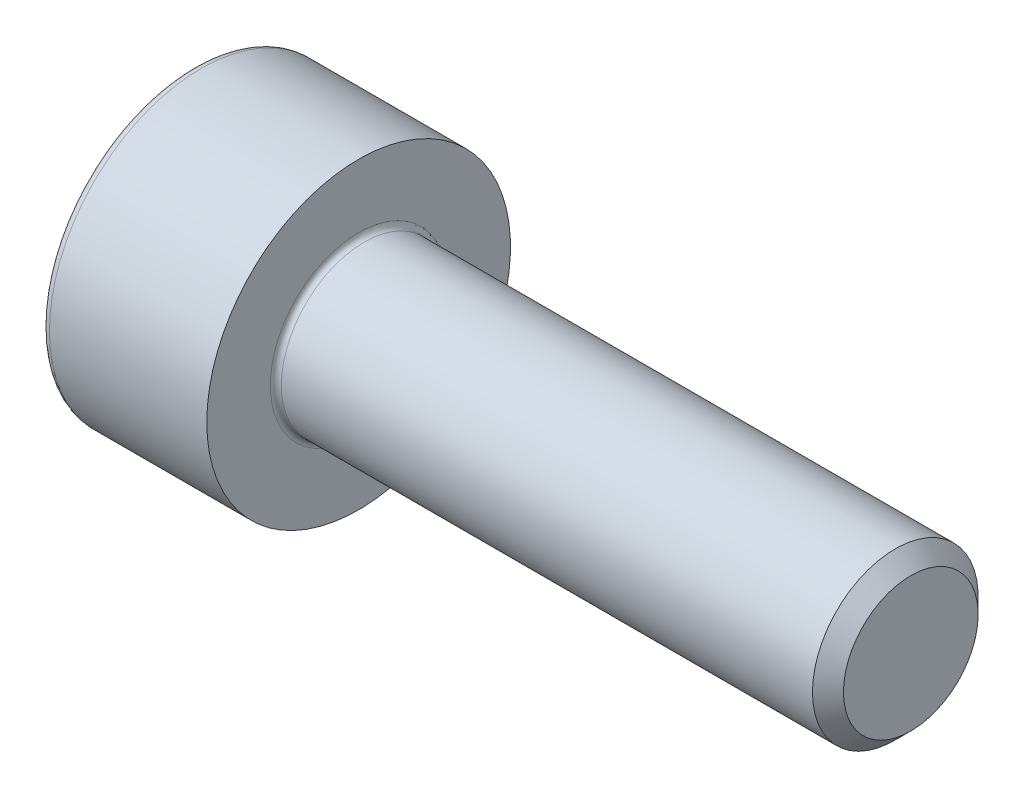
ISO-10303-21;
HEADER;
FILE_DESCRIPTION(('STEP AP214'),'2;1');
FILE_NAME('part.step','',(''),(''),'','','');
FILE_SCHEMA(('AUTOMOTIVE_DESIGN { 1 0 10303 214 1 1 1 1 }'));
ENDSEC;
DATA;
#1=APPLICATION_CONTEXT('core data for automotive mechanical design processes');
#2=APPLICATION_PROTOCOL_DEFINITION('international standard','automotive_design',2000,#1);
#3=PRODUCT_CONTEXT('',#1,'mechanical');
#4=PRODUCT('Part','Part','',(#3));
#5=PRODUCT_RELATED_PRODUCT_CATEGORY('part','',(#4));
#6=PRODUCT_DEFINITION_FORMATION('','',#4);
#7=PRODUCT_DEFINITION_CONTEXT('part definition',#1,'design');
#8=PRODUCT_DEFINITION('design','',#6,#7);
#9=PRODUCT_DEFINITION_SHAPE('','',#8);
#10=(LENGTH_UNIT() NAMED_UNIT(*) SI_UNIT(.MILLI.,.METRE.));
#11=(NAMED_UNIT(*) PLANE_ANGLE_UNIT() SI_UNIT($,.RADIAN.));
#12=(NAMED_UNIT(*) SI_UNIT($,.STERADIAN.) SOLID_ANGLE_UNIT());
#13=UNCERTAINTY_MEASURE_WITH_UNIT(LENGTH_MEASURE(1.E-05),#10,'distance_accuracy_value','');
#14=(GEOMETRIC_REPRESENTATION_CONTEXT(3) GLOBAL_UNCERTAINTY_ASSIGNED_CONTEXT((#13)) GLOBAL_UNIT_ASSIGNED_CONTEXT((#10,
#11,#12)) REPRESENTATION_CONTEXT('',''));
#15=CARTESIAN_POINT('',(0.,0.,0.));
#16=DIRECTION('',(0.,0.,1.));
#17=DIRECTION('',(1.,0.,0.));
#18=AXIS2_PLACEMENT_3D('',#15,#16,#17);
#19=CARTESIAN_POINT('',(0.,0.,0.));
#20=DIRECTION('',(-1.,0.,0.));
#21=DIRECTION('',(0.,0.,1.));
#22=AXIS2_PLACEMENT_3D('',#19,#20,#21);
#23=PLANE('',#22);
#24=DIRECTION('',(0.,-0.499999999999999,0.866025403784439));
#25=VECTOR('',#24,1.);
#26=CARTESIAN_POINT('',(0.,1.47801668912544,0.));
#27=LINE('',#26,#25);
#28=CARTESIAN_POINT('',(0.,1.47801668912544,0.));
#29=VERTEX_POINT('',#28);
#30=CARTESIAN_POINT('',(0.,0.739008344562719,1.28));
#31=VERTEX_POINT('',#30);
#32=EDGE_CURVE('E117',#29,#31,#27,.T.);
#33=ORIENTED_EDGE('',*,*,#32,.T.);
#34=DIRECTION('',(0.,1.,0.));
#35=VECTOR('',#34,1.);
#36=CARTESIAN_POINT('',(0.,-0.739008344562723,1.28));
#37=LINE('',#36,#35);
#38=CARTESIAN_POINT('',(0.,-0.739008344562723,1.28));
#39=VERTEX_POINT('',#38);
#40=EDGE_CURVE('E106',#39,#31,#37,.T.);
#41=ORIENTED_EDGE('',*,*,#40,.F.);
#42=DIRECTION('',(0.,-0.500000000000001,-0.866025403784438));
#43=VECTOR('',#42,1.);
#44=CARTESIAN_POINT('',(0.,-0.739008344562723,1.28));
#45=LINE('',#44,#43);
#46=CARTESIAN_POINT('',(0.,-1.47801668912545,0.));
#47=VERTEX_POINT('',#46);
#48=EDGE_CURVE('E116',#39,#47,#45,.T.);
#49=ORIENTED_EDGE('',*,*,#48,.T.);
#50=DIRECTION('',(0.,0.499999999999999,-0.866025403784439));
#51=VECTOR('',#50,1.);
#52=CARTESIAN_POINT('',(0.,-1.47801668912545,0.));
#53=LINE('',#52,#51);
#54=CARTESIAN_POINT('',(0.,-0.739008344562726,-1.28));
#55=VERTEX_POINT('',#54);
#56=EDGE_CURVE('E135',#47,#55,#53,.T.);
#57=ORIENTED_EDGE('',*,*,#56,.T.);
#58=DIRECTION('',(0.,-1.,0.));
#59=VECTOR('',#58,1.);
#60=CARTESIAN_POINT('',(0.,0.739008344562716,-1.28));
#61=LINE('',#60,#59);
#62=CARTESIAN_POINT('',(0.,0.739008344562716,-1.28));
#63=VERTEX_POINT('',#62);
#64=EDGE_CURVE('E138',#63,#55,#61,.T.);
#65=ORIENTED_EDGE('',*,*,#64,.F.);
#66=DIRECTION('',(0.,-0.500000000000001,-0.866025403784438));
#67=VECTOR('',#66,1.);
#68=CARTESIAN_POINT('',(0.,1.47801668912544,0.));
#69=LINE('',#68,#67);
#70=EDGE_CURVE('E131',#29,#63,#69,.T.);
#71=ORIENTED_EDGE('',*,*,#70,.F.);
#72=EDGE_LOOP('',(#33,#41,#49,#57,#65,#71));
#73=FACE_BOUND('',#72,.T.);
#74=CARTESIAN_POINT('',(0.,0.,0.));
#75=DIRECTION('',(-1.,0.,0.));
#76=DIRECTION('',(0.,0.,1.));
#77=AXIS2_PLACEMENT_3D('',#74,#75,#76);
#78=CIRCLE('',#77,2.6);
#79=CARTESIAN_POINT('',(0.,0.,2.6));
#80=VERTEX_POINT('',#79);
#81=EDGE_CURVE('E42',#80,#80,#78,.T.);
#82=ORIENTED_EDGE('',*,*,#81,.T.);
#83=EDGE_LOOP('',(#82));
#84=FACE_BOUND('',#83,.T.);
#85=ADVANCED_FACE('F35',(#73,#84),#23,.T.);
#86=CARTESIAN_POINT('',(-31.75,0.,0.));
#87=DIRECTION('',(-1.,0.,0.));
#88=DIRECTION('',(0.,0.,1.));
#89=AXIS2_PLACEMENT_3D('',#86,#87,#88);
#90=CYLINDRICAL_SURFACE('',#89,2.75);
#91=CARTESIAN_POINT('',(0.149999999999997,0.,0.));
#92=DIRECTION('',(-1.,0.,0.));
#93=DIRECTION('',(0.,0.,1.));
#94=AXIS2_PLACEMENT_3D('',#91,#92,#93);
#95=CIRCLE('',#94,2.75);
#96=CARTESIAN_POINT('',(0.149999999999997,0.,2.75));
#97=VERTEX_POINT('',#96);
#98=EDGE_CURVE('E11',#97,#97,#95,.F.);
#99=ORIENTED_EDGE('',*,*,#98,.T.);
#100=EDGE_LOOP('',(#99));
#101=FACE_BOUND('',#100,.T.);
#102=CARTESIAN_POINT('',(3.,0.,0.));
#103=DIRECTION('',(-1.,0.,0.));
#104=DIRECTION('',(0.,0.,1.));
#105=AXIS2_PLACEMENT_3D('',#102,#103,#104);
#106=CIRCLE('',#105,2.75);
#107=CARTESIAN_POINT('',(3.,0.,2.75));
#108=VERTEX_POINT('',#107);
#109=EDGE_CURVE('E183',#108,#108,#106,.T.);
#110=ORIENTED_EDGE('',*,*,#109,.T.);
#111=EDGE_LOOP('',(#110));
#112=FACE_BOUND('',#111,.T.);
#113=ADVANCED_FACE('F210',(#101,#112),#90,.T.);
#114=CARTESIAN_POINT('',(3.,2.75,0.));
#115=DIRECTION('',(1.,0.,0.));
#116=DIRECTION('',(0.,0.,-1.));
#117=AXIS2_PLACEMENT_3D('',#114,#115,#116);
#118=PLANE('',#117);
#119=CARTESIAN_POINT('',(3.,0.,0.));
#120=DIRECTION('',(1.,0.,0.));
#121=DIRECTION('',(0.,0.,-1.));
#122=AXIS2_PLACEMENT_3D('',#119,#120,#121);
#123=CIRCLE('',#122,1.6);
#124=CARTESIAN_POINT('',(3.,0.,-1.6));
#125=VERTEX_POINT('',#124);
#126=EDGE_CURVE('E186',#125,#125,#123,.F.);
#127=ORIENTED_EDGE('',*,*,#126,.T.);
#128=EDGE_LOOP('',(#127));
#129=FACE_BOUND('',#128,.T.);
#130=ORIENTED_EDGE('',*,*,#109,.F.);
#131=EDGE_LOOP('',(#130));
#132=FACE_BOUND('',#131,.T.);
#133=ADVANCED_FACE('F214',(#129,#132),#118,.T.);
#134=CARTESIAN_POINT('',(-31.75,0.,0.));
#135=DIRECTION('',(-1.,0.,0.));
#136=DIRECTION('',(0.,0.,1.));
#137=AXIS2_PLACEMENT_3D('',#134,#135,#136);
#138=CYLINDRICAL_SURFACE('',#137,1.5);
#139=CARTESIAN_POINT('',(3.1,0.,0.));
#140=DIRECTION('',(1.,0.,0.));
#141=DIRECTION('',(0.,0.,-1.));
#142=AXIS2_PLACEMENT_3D('',#139,#140,#141);
#143=CIRCLE('',#142,1.5);
#144=CARTESIAN_POINT('',(3.1,0.,-1.5));
#145=VERTEX_POINT('',#144);
#146=EDGE_CURVE('E189',#145,#145,#143,.T.);
#147=ORIENTED_EDGE('',*,*,#146,.T.);
#148=EDGE_LOOP('',(#147));
#149=FACE_BOUND('',#148,.T.);
#150=CARTESIAN_POINT('',(12.7195,0.,0.));
#151=DIRECTION('',(-1.,0.,0.));
#152=DIRECTION('',(0.,0.,1.));
#153=AXIS2_PLACEMENT_3D('',#150,#151,#152);
#154=CIRCLE('',#153,1.5);
#155=CARTESIAN_POINT('',(12.7195,0.,1.5));
#156=VERTEX_POINT('',#155);
#157=EDGE_CURVE('E180',#156,#156,#154,.T.);
#158=ORIENTED_EDGE('',*,*,#157,.T.);
#159=EDGE_LOOP('',(#158));
#160=FACE_BOUND('',#159,.T.);
#161=ADVANCED_FACE('F219',(#149,#160),#138,.T.);
#162=CARTESIAN_POINT('',(13.,0.,0.));
#163=DIRECTION('',(-1.,0.,0.));
#164=DIRECTION('',(0.,0.,1.));
#165=AXIS2_PLACEMENT_3D('',#162,#163,#164);
#166=CONICAL_SURFACE('',#165,1.2195,0.785398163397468);
#167=ORIENTED_EDGE('',*,*,#157,.F.);
#168=EDGE_LOOP('',(#167));
#169=FACE_BOUND('',#168,.T.);
#170=CARTESIAN_POINT('',(13.,0.,0.));
#171=DIRECTION('',(-1.,0.,0.));
#172=DIRECTION('',(0.,0.,1.));
#173=AXIS2_PLACEMENT_3D('',#170,#171,#172);
#174=CIRCLE('',#173,1.2195);
#175=CARTESIAN_POINT('',(13.,0.,1.2195));
#176=VERTEX_POINT('',#175);
#177=EDGE_CURVE('E176',#176,#176,#174,.T.);
#178=ORIENTED_EDGE('',*,*,#177,.T.);
#179=EDGE_LOOP('',(#178));
#180=FACE_BOUND('',#179,.T.);
#181=ADVANCED_FACE('F226',(#169,#180),#166,.T.);
#182=CARTESIAN_POINT('',(13.,1.2195,0.));
#183=DIRECTION('',(1.,0.,0.));
#184=DIRECTION('',(0.,0.,-1.));
#185=AXIS2_PLACEMENT_3D('',#182,#183,#184);
#186=PLANE('',#185);
#187=ORIENTED_EDGE('',*,*,#177,.F.);
#188=EDGE_LOOP('',(#187));
#189=FACE_BOUND('',#188,.T.);
#190=ADVANCED_FACE('F204',(#189),#186,.T.);
#191=CARTESIAN_POINT('',(3.1,0.,0.));
#192=DIRECTION('',(1.,0.,0.));
#193=DIRECTION('',(0.,0.,-1.));
#194=AXIS2_PLACEMENT_3D('',#191,#192,#193);
#195=TOROIDAL_SURFACE('',#194,1.6,0.1);
#196=ORIENTED_EDGE('',*,*,#146,.F.);
#197=EDGE_LOOP('',(#196));
#198=FACE_BOUND('',#197,.T.);
#199=ORIENTED_EDGE('',*,*,#126,.F.);
#200=EDGE_LOOP('',(#199));
#201=FACE_BOUND('',#200,.T.);
#202=ADVANCED_FACE('F196',(#198,#201),#195,.F.);
#203=CARTESIAN_POINT('',(0.149999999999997,0.,0.));
#204=DIRECTION('',(-1.,0.,0.));
#205=DIRECTION('',(0.,0.,1.));
#206=AXIS2_PLACEMENT_3D('',#203,#204,#205);
#207=TOROIDAL_SURFACE('',#206,2.6,0.15);
#208=ORIENTED_EDGE('',*,*,#98,.F.);
#209=EDGE_LOOP('',(#208));
#210=FACE_BOUND('',#209,.T.);
#211=ORIENTED_EDGE('',*,*,#81,.F.);
#212=EDGE_LOOP('',(#211));
#213=FACE_BOUND('',#212,.T.);
#214=ADVANCED_FACE('F194',(#210,#213),#207,.T.);
#215=CARTESIAN_POINT('',(1.3,1.47801668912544,0.));
#216=DIRECTION('',(0.,-0.866025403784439,-0.499999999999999));
#217=DIRECTION('',(0.,0.499999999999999,-0.866025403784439));
#218=AXIS2_PLACEMENT_3D('',#215,#216,#217);
#219=PLANE('',#218);
#220=ORIENTED_EDGE('',*,*,#32,.F.);
#221=DIRECTION('',(-1.,0.,0.));
#222=VECTOR('',#221,1.);
#223=CARTESIAN_POINT('',(1.3,1.47801668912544,0.));
#224=LINE('',#223,#222);
#225=CARTESIAN_POINT('',(1.3,1.47801668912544,0.));
#226=VERTEX_POINT('',#225);
#227=EDGE_CURVE('E161',#226,#29,#224,.T.);
#228=ORIENTED_EDGE('',*,*,#227,.F.);
#229=DIRECTION('',(0.,-0.499999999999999,0.866025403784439));
#230=VECTOR('',#229,1.);
#231=CARTESIAN_POINT('',(1.3,1.47801668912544,0.));
#232=LINE('',#231,#230);
#233=CARTESIAN_POINT('',(1.3,1.10851251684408,0.639999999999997));
#234=VERTEX_POINT('',#233);
#235=EDGE_CURVE('E141',#226,#234,#232,.T.);
#236=ORIENTED_EDGE('',*,*,#235,.T.);
#237=CARTESIAN_POINT('',(1.3,0.739008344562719,1.28));
#238=VERTEX_POINT('',#237);
#239=EDGE_CURVE('E125',#234,#238,#232,.T.);
#240=ORIENTED_EDGE('',*,*,#239,.T.);
#241=DIRECTION('',(-1.,0.,0.));
#242=VECTOR('',#241,1.);
#243=CARTESIAN_POINT('',(1.3,0.739008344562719,1.28));
#244=LINE('',#243,#242);
#245=EDGE_CURVE('E110',#238,#31,#244,.T.);
#246=ORIENTED_EDGE('',*,*,#245,.T.);
#247=EDGE_LOOP('',(#220,#228,#236,#240,#246));
#248=FACE_BOUND('',#247,.T.);
#249=ADVANCED_FACE('F121',(#248),#219,.T.);
#250=CARTESIAN_POINT('',(1.3,-0.739008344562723,1.28));
#251=DIRECTION('',(0.,0.,1.));
#252=DIRECTION('',(0.,-1.,0.));
#253=AXIS2_PLACEMENT_3D('',#250,#251,#252);
#254=PLANE('',#253);
#255=ORIENTED_EDGE('',*,*,#40,.T.);
#256=ORIENTED_EDGE('',*,*,#245,.F.);
#257=DIRECTION('',(0.,1.,0.));
#258=VECTOR('',#257,1.);
#259=CARTESIAN_POINT('',(1.3,-0.739008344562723,1.28));
#260=LINE('',#259,#258);
#261=CARTESIAN_POINT('',(1.3,0.,1.28));
#262=VERTEX_POINT('',#261);
#263=EDGE_CURVE('E143',#262,#238,#260,.T.);
#264=ORIENTED_EDGE('',*,*,#263,.F.);
#265=CARTESIAN_POINT('',(1.3,-0.739008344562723,1.28));
#266=VERTEX_POINT('',#265);
#267=EDGE_CURVE('E144',#266,#262,#260,.T.);
#268=ORIENTED_EDGE('',*,*,#267,.F.);
#269=DIRECTION('',(-1.,0.,0.));
#270=VECTOR('',#269,1.);
#271=CARTESIAN_POINT('',(1.3,-0.739008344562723,1.28));
#272=LINE('',#271,#270);
#273=EDGE_CURVE('E112',#266,#39,#272,.T.);
#274=ORIENTED_EDGE('',*,*,#273,.T.);
#275=EDGE_LOOP('',(#255,#256,#264,#268,#274));
#276=FACE_BOUND('',#275,.T.);
#277=ADVANCED_FACE('F108',(#276),#254,.F.);
#278=CARTESIAN_POINT('',(1.3,-0.739008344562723,1.28));
#279=DIRECTION('',(0.,0.866025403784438,-0.500000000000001));
#280=DIRECTION('',(0.,0.500000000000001,0.866025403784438));
#281=AXIS2_PLACEMENT_3D('',#278,#279,#280);
#282=PLANE('',#281);
#283=ORIENTED_EDGE('',*,*,#48,.F.);
#284=ORIENTED_EDGE('',*,*,#273,.F.);
#285=DIRECTION('',(0.,-0.500000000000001,-0.866025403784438));
#286=VECTOR('',#285,1.);
#287=CARTESIAN_POINT('',(1.3,-0.739008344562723,1.28));
#288=LINE('',#287,#286);
#289=CARTESIAN_POINT('',(1.3,-1.10851251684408,0.640000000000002));
#290=VERTEX_POINT('',#289);
#291=EDGE_CURVE('E148',#266,#290,#288,.T.);
#292=ORIENTED_EDGE('',*,*,#291,.T.);
#293=CARTESIAN_POINT('',(1.3,-1.47801668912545,0.));
#294=VERTEX_POINT('',#293);
#295=EDGE_CURVE('E147',#290,#294,#288,.T.);
#296=ORIENTED_EDGE('',*,*,#295,.T.);
#297=DIRECTION('',(-1.,0.,0.));
#298=VECTOR('',#297,1.);
#299=CARTESIAN_POINT('',(1.3,-1.47801668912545,0.));
#300=LINE('',#299,#298);
#301=EDGE_CURVE('E169',#294,#47,#300,.T.);
#302=ORIENTED_EDGE('',*,*,#301,.T.);
#303=EDGE_LOOP('',(#283,#284,#292,#296,#302));
#304=FACE_BOUND('',#303,.T.);
#305=ADVANCED_FACE('F277',(#304),#282,.T.);
#306=CARTESIAN_POINT('',(1.3,-1.47801668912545,0.));
#307=DIRECTION('',(0.,0.866025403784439,0.499999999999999));
#308=DIRECTION('',(0.,-0.499999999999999,0.866025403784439));
#309=AXIS2_PLACEMENT_3D('',#306,#307,#308);
#310=PLANE('',#309);
#311=ORIENTED_EDGE('',*,*,#56,.F.);
#312=ORIENTED_EDGE('',*,*,#301,.F.);
#313=DIRECTION('',(0.,0.499999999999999,-0.866025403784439));
#314=VECTOR('',#313,1.);
#315=CARTESIAN_POINT('',(1.3,-1.47801668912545,0.));
#316=LINE('',#315,#314);
#317=CARTESIAN_POINT('',(1.3,-1.10851251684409,-0.640000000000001));
#318=VERTEX_POINT('',#317);
#319=EDGE_CURVE('E152',#294,#318,#316,.T.);
#320=ORIENTED_EDGE('',*,*,#319,.T.);
#321=CARTESIAN_POINT('',(1.3,-0.739008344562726,-1.28));
#322=VERTEX_POINT('',#321);
#323=EDGE_CURVE('E151',#318,#322,#316,.T.);
#324=ORIENTED_EDGE('',*,*,#323,.T.);
#325=DIRECTION('',(-1.,0.,0.));
#326=VECTOR('',#325,1.);
#327=CARTESIAN_POINT('',(1.3,-0.739008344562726,-1.28));
#328=LINE('',#327,#326);
#329=EDGE_CURVE('E166',#322,#55,#328,.T.);
#330=ORIENTED_EDGE('',*,*,#329,.T.);
#331=EDGE_LOOP('',(#311,#312,#320,#324,#330));
#332=FACE_BOUND('',#331,.T.);
#333=ADVANCED_FACE('F286',(#332),#310,.T.);
#334=CARTESIAN_POINT('',(1.3,0.739008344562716,-1.28));
#335=DIRECTION('',(0.,0.,-1.));
#336=DIRECTION('',(0.,1.,0.));
#337=AXIS2_PLACEMENT_3D('',#334,#335,#336);
#338=PLANE('',#337);
#339=ORIENTED_EDGE('',*,*,#64,.T.);
#340=ORIENTED_EDGE('',*,*,#329,.F.);
#341=DIRECTION('',(0.,-1.,0.));
#342=VECTOR('',#341,1.);
#343=CARTESIAN_POINT('',(1.3,0.739008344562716,-1.28));
#344=LINE('',#343,#342);
#345=CARTESIAN_POINT('',(1.3,0.,-1.28));
#346=VERTEX_POINT('',#345);
#347=EDGE_CURVE('E155',#346,#322,#344,.T.);
#348=ORIENTED_EDGE('',*,*,#347,.F.);
#349=CARTESIAN_POINT('',(1.3,0.739008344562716,-1.28));
#350=VERTEX_POINT('',#349);
#351=EDGE_CURVE('E49',#350,#346,#344,.T.);
#352=ORIENTED_EDGE('',*,*,#351,.F.);
#353=DIRECTION('',(-1.,0.,0.));
#354=VECTOR('',#353,1.);
#355=CARTESIAN_POINT('',(1.3,0.739008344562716,-1.28));
#356=LINE('',#355,#354);
#357=EDGE_CURVE('E163',#350,#63,#356,.T.);
#358=ORIENTED_EDGE('',*,*,#357,.T.);
#359=EDGE_LOOP('',(#339,#340,#348,#352,#358));
#360=FACE_BOUND('',#359,.T.);
#361=ADVANCED_FACE('F296',(#360),#338,.F.);
#362=CARTESIAN_POINT('',(1.3,1.47801668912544,0.));
#363=DIRECTION('',(0.,0.866025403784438,-0.500000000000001));
#364=DIRECTION('',(0.,0.500000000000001,0.866025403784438));
#365=AXIS2_PLACEMENT_3D('',#362,#363,#364);
#366=PLANE('',#365);
#367=ORIENTED_EDGE('',*,*,#70,.T.);
#368=ORIENTED_EDGE('',*,*,#357,.F.);
#369=DIRECTION('',(0.,-0.500000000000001,-0.866025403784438));
#370=VECTOR('',#369,1.);
#371=CARTESIAN_POINT('',(1.3,1.47801668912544,0.));
#372=LINE('',#371,#370);
#373=CARTESIAN_POINT('',(1.3,1.10851251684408,-0.640000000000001));
#374=VERTEX_POINT('',#373);
#375=EDGE_CURVE('E157',#374,#350,#372,.T.);
#376=ORIENTED_EDGE('',*,*,#375,.F.);
#377=EDGE_CURVE('E158',#226,#374,#372,.T.);
#378=ORIENTED_EDGE('',*,*,#377,.F.);
#379=ORIENTED_EDGE('',*,*,#227,.T.);
#380=EDGE_LOOP('',(#367,#368,#376,#378,#379));
#381=FACE_BOUND('',#380,.T.);
#382=ADVANCED_FACE('F306',(#381),#366,.F.);
#383=CARTESIAN_POINT('',(1.3,1.47801668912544,0.));
#384=DIRECTION('',(1.,0.,0.));
#385=DIRECTION('',(0.,0.,-1.));
#386=AXIS2_PLACEMENT_3D('',#383,#384,#385);
#387=PLANE('',#386);
#388=ORIENTED_EDGE('',*,*,#347,.T.);
#389=ORIENTED_EDGE('',*,*,#323,.F.);
#390=CARTESIAN_POINT('',(1.3,0.,0.));
#391=DIRECTION('',(-1.,0.,0.));
#392=DIRECTION('',(0.,0.,1.));
#393=AXIS2_PLACEMENT_3D('',#390,#391,#392);
#394=CIRCLE('',#393,1.28);
#395=EDGE_CURVE('E392',#346,#318,#394,.T.);
#396=ORIENTED_EDGE('',*,*,#395,.F.);
#397=EDGE_LOOP('',(#388,#389,#396));
#398=FACE_BOUND('',#397,.T.);
#399=ADVANCED_FACE('F316',(#398),#387,.F.);
#400=ORIENTED_EDGE('',*,*,#319,.F.);
#401=ORIENTED_EDGE('',*,*,#295,.F.);
#402=EDGE_CURVE('E390',#318,#290,#394,.T.);
#403=ORIENTED_EDGE('',*,*,#402,.F.);
#404=EDGE_LOOP('',(#400,#401,#403));
#405=FACE_BOUND('',#404,.T.);
#406=ADVANCED_FACE('F326',(#405),#387,.F.);
#407=ORIENTED_EDGE('',*,*,#291,.F.);
#408=ORIENTED_EDGE('',*,*,#267,.T.);
#409=EDGE_CURVE('E126',#290,#262,#394,.T.);
#410=ORIENTED_EDGE('',*,*,#409,.F.);
#411=EDGE_LOOP('',(#407,#408,#410));
#412=FACE_BOUND('',#411,.T.);
#413=ADVANCED_FACE('F337',(#412),#387,.F.);
#414=ORIENTED_EDGE('',*,*,#263,.T.);
#415=ORIENTED_EDGE('',*,*,#239,.F.);
#416=EDGE_CURVE('E173',#262,#234,#394,.T.);
#417=ORIENTED_EDGE('',*,*,#416,.F.);
#418=EDGE_LOOP('',(#414,#415,#417));
#419=FACE_BOUND('',#418,.T.);
#420=ADVANCED_FACE('F346',(#419),#387,.F.);
#421=ORIENTED_EDGE('',*,*,#235,.F.);
#422=ORIENTED_EDGE('',*,*,#377,.T.);
#423=EDGE_CURVE('E177',#234,#374,#394,.T.);
#424=ORIENTED_EDGE('',*,*,#423,.F.);
#425=EDGE_LOOP('',(#421,#422,#424));
#426=FACE_BOUND('',#425,.T.);
#427=ADVANCED_FACE('F355',(#426),#387,.F.);
#428=ORIENTED_EDGE('',*,*,#375,.T.);
#429=ORIENTED_EDGE('',*,*,#351,.T.);
#430=EDGE_CURVE('E395',#374,#346,#394,.T.);
#431=ORIENTED_EDGE('',*,*,#430,.F.);
#432=EDGE_LOOP('',(#428,#429,#431));
#433=FACE_BOUND('',#432,.T.);
#434=ADVANCED_FACE('F329',(#433),#387,.F.);
#435=CARTESIAN_POINT('',(1.3,0.,0.));
#436=DIRECTION('',(-1.,0.,0.));
#437=DIRECTION('',(0.,0.,1.));
#438=AXIS2_PLACEMENT_3D('',#435,#436,#437);
#439=CONICAL_SURFACE('',#438,1.28,1.04719755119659);
#440=CARTESIAN_POINT('',(2.03900834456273,0.,0.));
#441=VERTEX_POINT('',#440);
#442=VERTEX_LOOP('',#441);
#443=FACE_BOUND('',#442,.T.);
#444=ORIENTED_EDGE('',*,*,#416,.T.);
#445=ORIENTED_EDGE('',*,*,#423,.T.);
#446=ORIENTED_EDGE('',*,*,#430,.T.);
#447=ORIENTED_EDGE('',*,*,#395,.T.);
#448=ORIENTED_EDGE('',*,*,#402,.T.);
#449=ORIENTED_EDGE('',*,*,#409,.T.);
#450=EDGE_LOOP('',(#444,#445,#446,#447,#448,#449));
#451=FACE_BOUND('',#450,.T.);
#452=ADVANCED_FACE('F372',(#443,#451),#439,.F.);
#453=CLOSED_SHELL('',(#85,#113,#133,#161,#181,#190,#202,#214,#249,#277,#305,#333,#361,#382,#399,
#406,#413,#420,#427,#434,#452));
#454=MANIFOLD_SOLID_BREP('B2',#453);
#455=ADVANCED_BREP_SHAPE_REPRESENTATION('',(#18,#454),#14);
#456=SHAPE_DEFINITION_REPRESENTATION(#9,#455);
ENDSEC;
END-ISO-10303-21;
